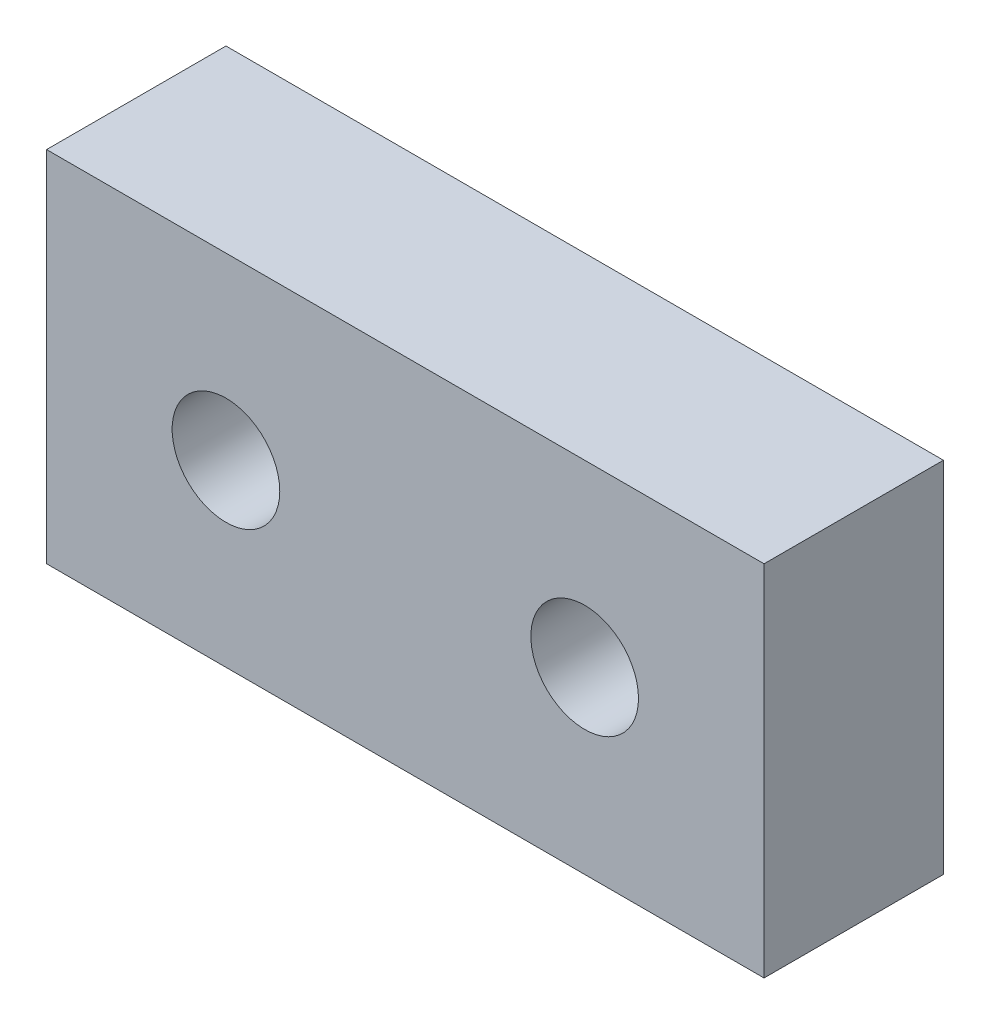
from build123d import *

# Parameters (mm, degrees)
SKIZZE1_W                       = 200
SKIZZE1_H                       = 100
BASIS_LINEAR_AUSTRAGEN_DEPTH    = 50
SKIZZE2_R                       = 15
SCHNITT_LINEAR_AUSTRAGEN1_DEPTH = 123.474487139


with BuildPart() as part:
    # Skizze1 → Basis-Linear austragen (new body)
    with BuildSketch(Plane.XY):
        Rectangle(SKIZZE1_W, SKIZZE1_H)
    extrude(amount=BASIS_LINEAR_AUSTRAGEN_DEPTH)

    # Skizze2 → Schnitt-Linear austragen1 (cut, through all)
    with BuildSketch(Plane.XY.offset(50)):
        with Locations((-50, 0)):
            Circle(SKIZZE2_R)
        with Locations((50, 0)):
            Circle(SKIZZE2_R)
    extrude(amount=-SCHNITT_LINEAR_AUSTRAGEN1_DEPTH, mode=Mode.SUBTRACT)


solid = part.part
